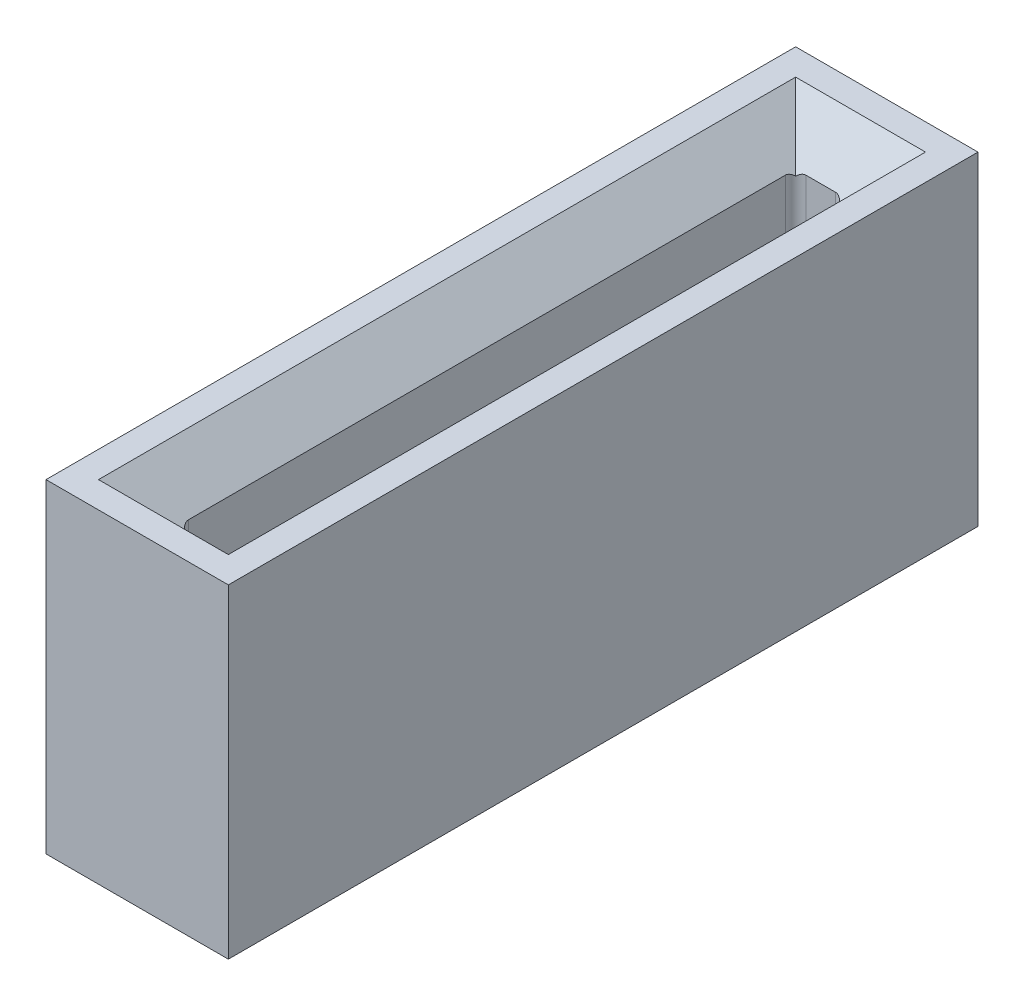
from build123d import *

# Parameters (mm, degrees)
SK_BLOCK_W          = 228.6
SK_BLOCK_H          = 939.8
SK_BLOCK_W_2        = 62.8
SK_BLOCK_H_2        = 774
BOSS_EXTRUDE1_DEPTH = 203.2
CHAMFER1_SIZE       = 50
FILLET1_R           = 13


with BuildPart() as part:
    # sk block → Boss-Extrude1 (new, symmetric)
    with BuildSketch(Plane(origin=(0, 0, 0), x_dir=(-1, 0, 0), z_dir=(0, 1, 0))):
        Rectangle(SK_BLOCK_W, SK_BLOCK_H)
        Rectangle(SK_BLOCK_W_2, SK_BLOCK_H_2, mode=Mode.SUBTRACT)
    extrude(amount=BOSS_EXTRUDE1_DEPTH, both=True)

    # Chamfer1
    chamfer1_edges = [part.edges().sort_by_distance(p)[0] for p in [
        (0, -203.2, 387),
        (31.4, -203.2, 0),
        (0, -203.2, -387),
        (-31.4, -203.2, 0),
        (0, 203.2, 387),
        (31.4, 203.2, 0),
        (0, 203.2, -387),
        (-31.4, 203.2, 0),
    ]]
    chamfer(chamfer1_edges, length=CHAMFER1_SIZE)

    # Fillet1
    fillet1_edges = [part.edges().sort_by_distance(p)[0] for p in [
        (-31.4, 0, -387),
        (-31.4, 0, 387),
        (31.4, 0, 387),
        (31.4, 0, -387),
    ]]
    fillet(fillet1_edges, radius=FILLET1_R)


solid = part.part
